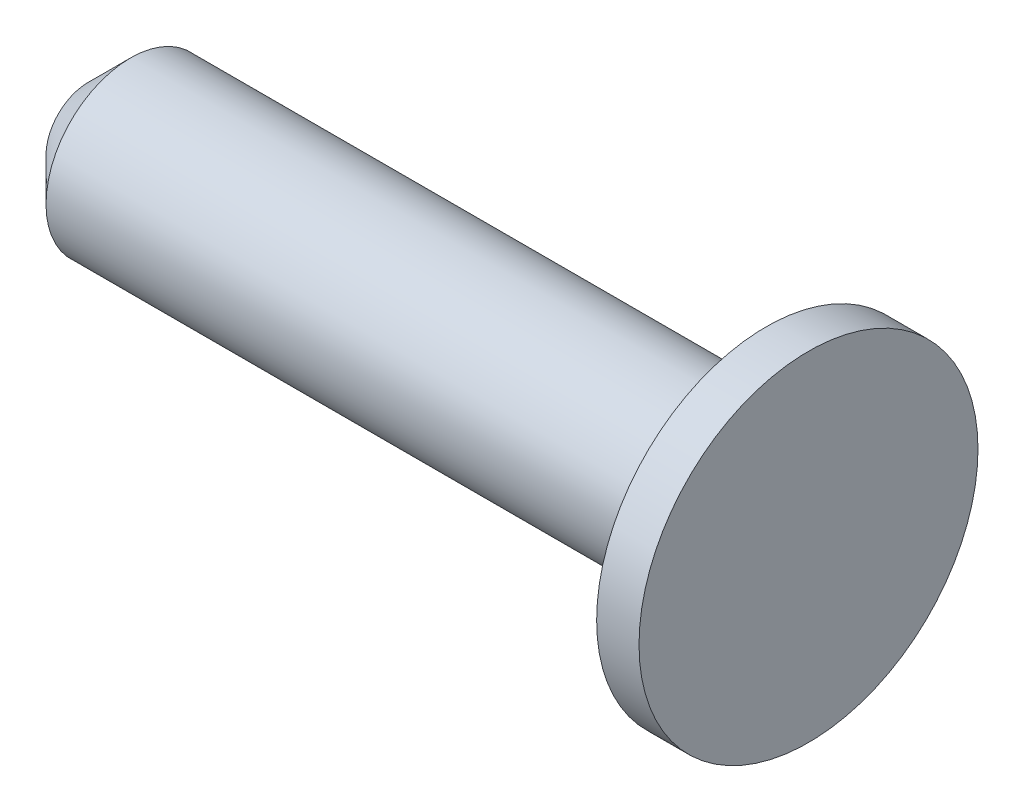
from build123d import *

# Parameters (mm, degrees)
CHAMFER1_SIZE = 1


with BuildPart() as part:
    # Sketch3 → Revolve1 (revolve)
    with BuildSketch(Plane.XY, mode=Mode.PRIVATE) as revolve1_sk:
        Polygon((0, 0), (0, 1.995), (16, 1.995), (16, 4), (17, 4), (17, 0), align=None)
    revolve(revolve1_sk.sketch.rotate(Axis((0, 0, 0), (1, 0, 0)), 90), axis=Axis((0, 0, 0), (1, 0, 0)))

    # Chamfer1
    chamfer1_edges = [part.edges().sort_by_distance(p)[0] for p in [
        (0, 0, -1.995),
    ]]
    chamfer(chamfer1_edges, length=CHAMFER1_SIZE)


solid = part.part
